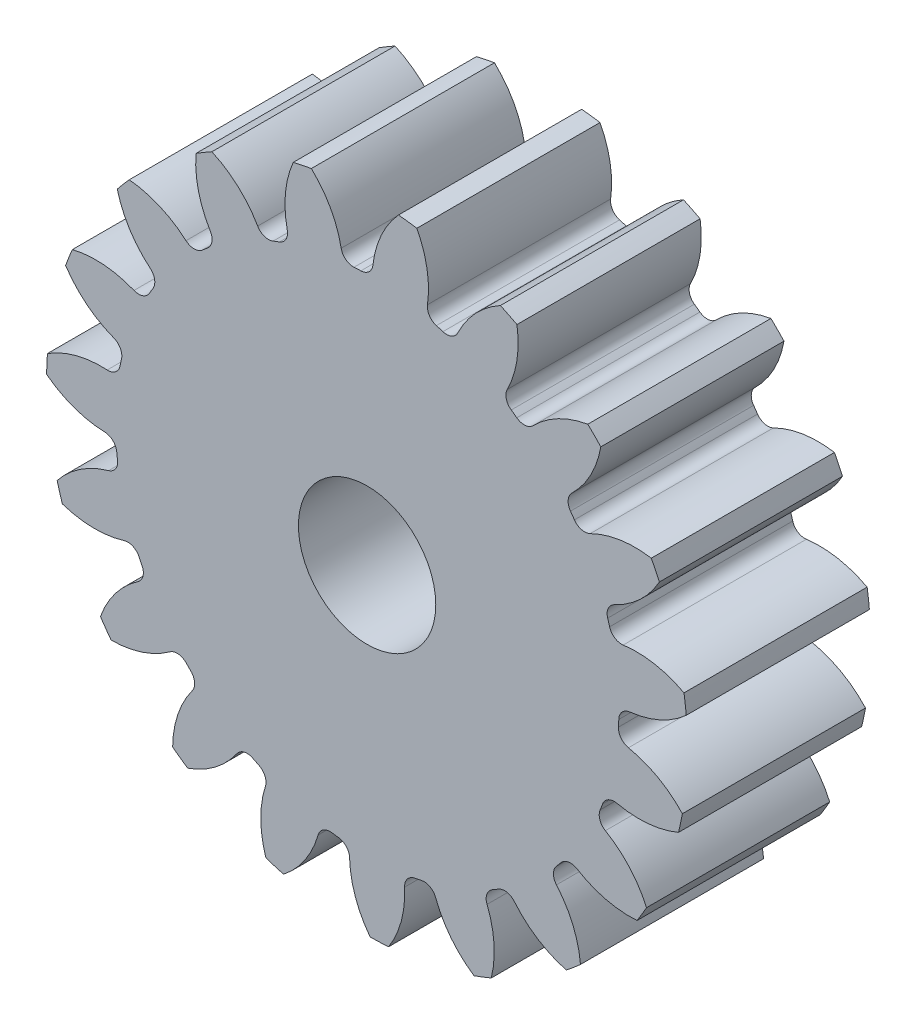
from build123d import *

# Parameters (mm, degrees)
SKETCH3_R         = 177.8
GEARBODY_DEPTH    = 101.6
TOOTHCUT_DEPTH    = 272.197787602
CIRPATTERN1_COUNT = 19
BOREDIA_R         = 38.1
BORE_DEPTH        = 12700


with BuildPart() as part:
    # Sketch3 → gearBody (new body)
    with BuildSketch(Plane.XY):
        Circle(SKETCH3_R)
    extrude(amount=GEARBODY_DEPTH)

    # Sketch2 → toothCut (cut, through all)
    with BuildSketch(Plane.XY):
        with BuildLine():
            ThreePointArc((139.46582983, -8.085314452), (139.562588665, -6.194662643), (139.633718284, -4.30287325))
            ThreePointArc((139.633718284, -4.30287325), (141.460818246, 0.16235915), (145.768335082, 2.335350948))
            ThreePointArc((145.768335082, 2.335350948), (162.975842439, 7.100702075), (177.8, 17.053150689))
            ThreePointArc((177.8, 17.053150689), (178.440238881, -7.920296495), (175.589920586, -32.738810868))
            ThreePointArc((175.589920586, -32.738810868), (161.705826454, -21.512110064), (144.98818873, -15.240948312))
            ThreePointArc((144.98818873, -15.240948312), (140.890134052, -12.694864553), (139.46582983, -8.085314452))
        make_face()
    toothcut = extrude(amount=TOOTHCUT_DEPTH, mode=Mode.SUBTRACT)

    # CirPattern1: toothCut ×19 about axis
    cirpattern1_axis = Axis((0, 0, 0), (0, 0, 1))
    for i in range(1, CIRPATTERN1_COUNT):
        add(toothcut.rotate(cirpattern1_axis, i * 360 / CIRPATTERN1_COUNT), mode=Mode.SUBTRACT)

    # boreDia → bore (cut, symmetric)
    with BuildSketch(Plane.XY):
        Circle(BOREDIA_R)
    extrude(amount=BORE_DEPTH, both=True, mode=Mode.SUBTRACT)


solid = part.part
